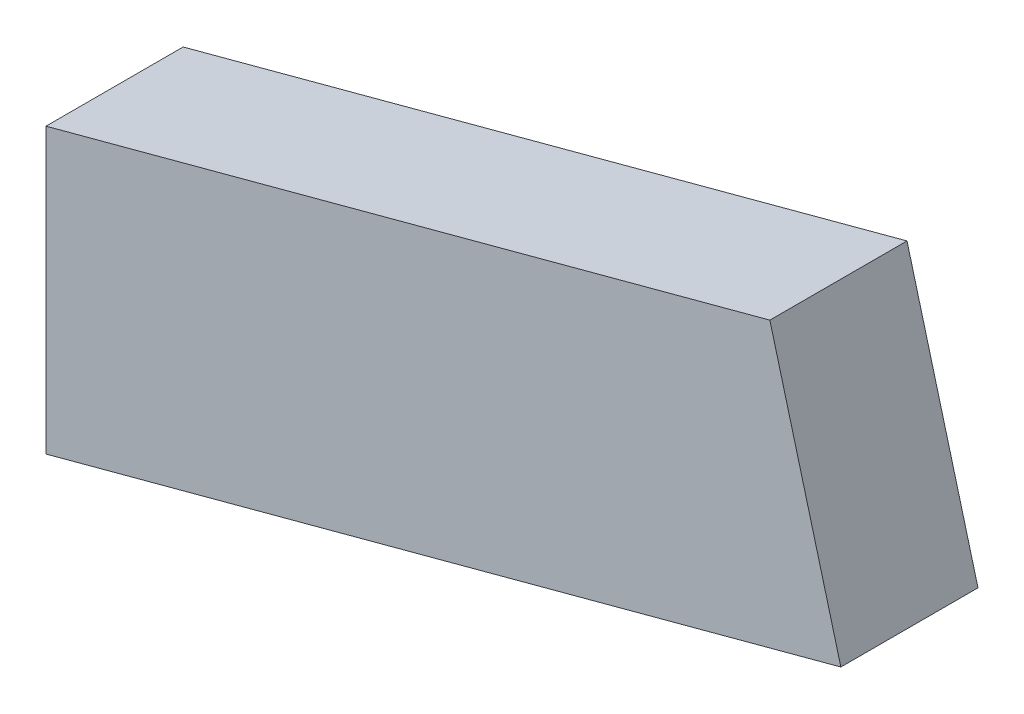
from build123d import *

# Parameters (mm, degrees)
EXTRUDE1_DEPTH = 12.7


with BuildPart() as part:
    # Sketch1 → Extrude1 (new body)
    with BuildSketch(Plane.XY):
        Polygon((0, 0), (73.603547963, 19.722011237), (67.029544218, 44.256527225), (0, 26.296014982), align=None)
    extrude(amount=EXTRUDE1_DEPTH)


solid = part.part
